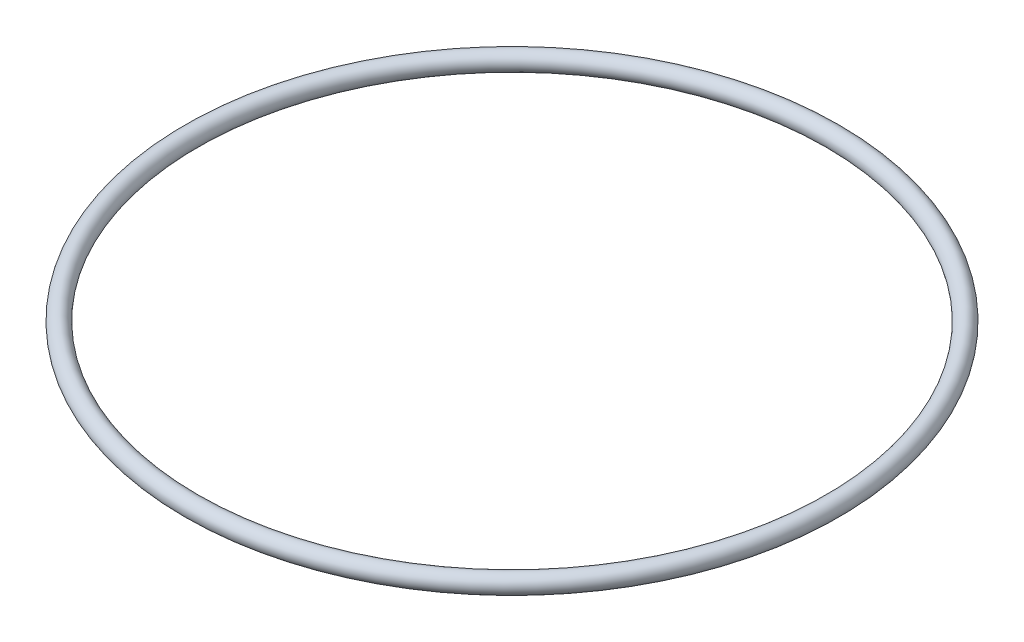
from build123d import *

# Parameters (mm, degrees)
ESQUISSE1_R = 3


with BuildPart() as part:
    # Esquisse1 → R_volution1 (revolve)
    with BuildSketch(Plane.XY, mode=Mode.PRIVATE) as r_volution1_sk:
        with Locations((105.5, 3)):
            Circle(ESQUISSE1_R)
    revolve(r_volution1_sk.sketch.rotate(Axis((0, 45.569153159, 0), (0, -1, 0)), 90), axis=Axis((0, 45.569153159, 0), (0, -1, 0)))


solid = part.part
